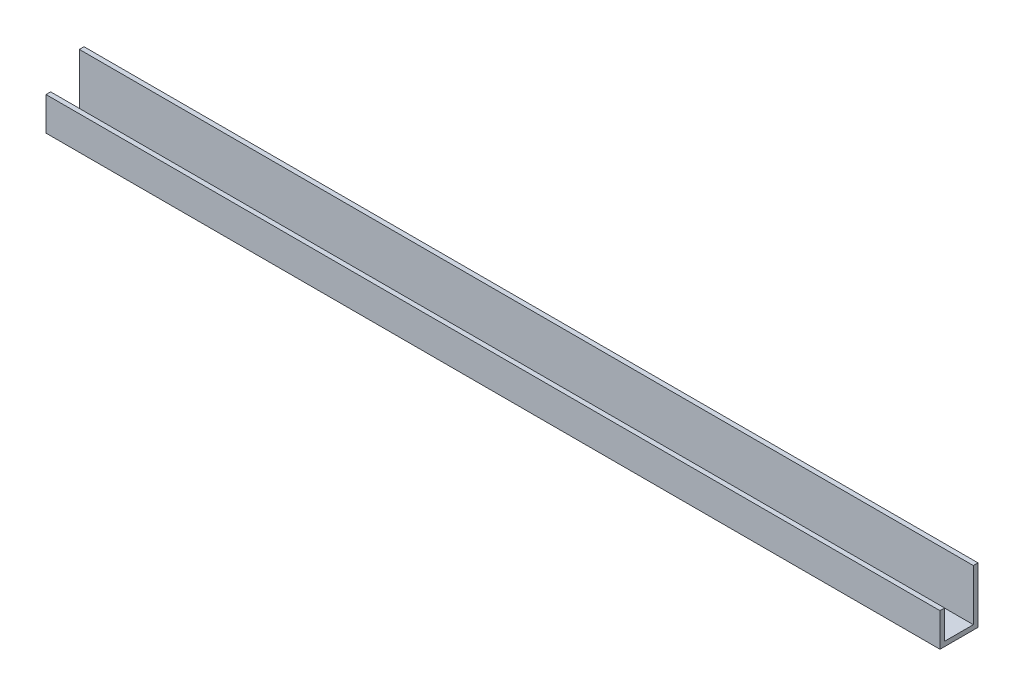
ISO-10303-21;
HEADER;
FILE_DESCRIPTION(('STEP AP214'),'2;1');
FILE_NAME('part.step','',(''),(''),'','','');
FILE_SCHEMA(('AUTOMOTIVE_DESIGN { 1 0 10303 214 1 1 1 1 }'));
ENDSEC;
DATA;
#1=APPLICATION_CONTEXT('core data for automotive mechanical design processes');
#2=APPLICATION_PROTOCOL_DEFINITION('international standard','automotive_design',2000,#1);
#3=PRODUCT_CONTEXT('',#1,'mechanical');
#4=PRODUCT('Part','Part','',(#3));
#5=PRODUCT_RELATED_PRODUCT_CATEGORY('part','',(#4));
#6=PRODUCT_DEFINITION_FORMATION('','',#4);
#7=PRODUCT_DEFINITION_CONTEXT('part definition',#1,'design');
#8=PRODUCT_DEFINITION('design','',#6,#7);
#9=PRODUCT_DEFINITION_SHAPE('','',#8);
#10=(LENGTH_UNIT() NAMED_UNIT(*) SI_UNIT(.MILLI.,.METRE.));
#11=(NAMED_UNIT(*) PLANE_ANGLE_UNIT() SI_UNIT($,.RADIAN.));
#12=(NAMED_UNIT(*) SI_UNIT($,.STERADIAN.) SOLID_ANGLE_UNIT());
#13=UNCERTAINTY_MEASURE_WITH_UNIT(LENGTH_MEASURE(1.E-05),#10,'distance_accuracy_value','');
#14=(GEOMETRIC_REPRESENTATION_CONTEXT(3) GLOBAL_UNCERTAINTY_ASSIGNED_CONTEXT((#13)) GLOBAL_UNIT_ASSIGNED_CONTEXT((#10,
#11,#12)) REPRESENTATION_CONTEXT('',''));
#15=CARTESIAN_POINT('',(0.,0.,0.));
#16=DIRECTION('',(0.,0.,1.));
#17=DIRECTION('',(1.,0.,0.));
#18=AXIS2_PLACEMENT_3D('',#15,#16,#17);
#19=CARTESIAN_POINT('',(0.,19.05,0.));
#20=DIRECTION('',(0.,1.,0.));
#21=DIRECTION('',(0.,0.,1.));
#22=AXIS2_PLACEMENT_3D('',#19,#20,#21);
#23=PLANE('',#22);
#24=DIRECTION('',(-1.,0.,0.));
#25=VECTOR('',#24,1.);
#26=CARTESIAN_POINT('',(0.,19.05,1.5875));
#27=LINE('',#26,#25);
#28=CARTESIAN_POINT('',(304.8,19.05,1.5875));
#29=VERTEX_POINT('',#28);
#30=CARTESIAN_POINT('',(0.,19.05,1.5875));
#31=VERTEX_POINT('',#30);
#32=EDGE_CURVE('E165',#29,#31,#27,.T.);
#33=ORIENTED_EDGE('',*,*,#32,.F.);
#34=DIRECTION('',(0.,0.,-1.));
#35=VECTOR('',#34,1.);
#36=CARTESIAN_POINT('',(304.8,19.05,0.));
#37=LINE('',#36,#35);
#38=CARTESIAN_POINT('',(304.8,19.05,0.));
#39=VERTEX_POINT('',#38);
#40=EDGE_CURVE('E177',#29,#39,#37,.T.);
#41=ORIENTED_EDGE('',*,*,#40,.T.);
#42=DIRECTION('',(-1.,0.,0.));
#43=VECTOR('',#42,1.);
#44=CARTESIAN_POINT('',(0.,19.05,0.));
#45=LINE('',#44,#43);
#46=CARTESIAN_POINT('',(0.,19.05,0.));
#47=VERTEX_POINT('',#46);
#48=EDGE_CURVE('E70',#39,#47,#45,.T.);
#49=ORIENTED_EDGE('',*,*,#48,.T.);
#50=DIRECTION('',(0.,0.,1.));
#51=VECTOR('',#50,1.);
#52=CARTESIAN_POINT('',(0.,19.05,0.));
#53=LINE('',#52,#51);
#54=EDGE_CURVE('E99',#47,#31,#53,.T.);
#55=ORIENTED_EDGE('',*,*,#54,.T.);
#56=EDGE_LOOP('',(#33,#41,#49,#55));
#57=FACE_BOUND('',#56,.T.);
#58=ADVANCED_FACE('F45',(#57),#23,.T.);
#59=CARTESIAN_POINT('',(0.,19.05,0.));
#60=DIRECTION('',(1.,0.,0.));
#61=DIRECTION('',(0.,0.,-1.));
#62=AXIS2_PLACEMENT_3D('',#59,#60,#61);
#63=PLANE('',#62);
#64=DIRECTION('',(0.,-1.,0.));
#65=VECTOR('',#64,1.);
#66=CARTESIAN_POINT('',(0.,19.05,12.954));
#67=LINE('',#66,#65);
#68=CARTESIAN_POINT('',(0.,11.4046,12.954));
#69=VERTEX_POINT('',#68);
#70=CARTESIAN_POINT('',(0.,0.,12.954));
#71=VERTEX_POINT('',#70);
#72=EDGE_CURVE('E11',#69,#71,#67,.T.);
#73=ORIENTED_EDGE('',*,*,#72,.F.);
#74=DIRECTION('',(0.,0.,1.));
#75=VECTOR('',#74,1.);
#76=CARTESIAN_POINT('',(0.,11.4046,-0.000999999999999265));
#77=LINE('',#76,#75);
#78=CARTESIAN_POINT('',(0.,11.4046,11.3665));
#79=VERTEX_POINT('',#78);
#80=EDGE_CURVE('E142',#79,#69,#77,.T.);
#81=ORIENTED_EDGE('',*,*,#80,.F.);
#82=DIRECTION('',(0.,1.,0.));
#83=VECTOR('',#82,1.);
#84=CARTESIAN_POINT('',(0.,1.5875,11.3665));
#85=LINE('',#84,#83);
#86=CARTESIAN_POINT('',(0.,1.5875,11.3665));
#87=VERTEX_POINT('',#86);
#88=EDGE_CURVE('E181',#87,#79,#85,.T.);
#89=ORIENTED_EDGE('',*,*,#88,.F.);
#90=DIRECTION('',(0.,0.,1.));
#91=VECTOR('',#90,1.);
#92=CARTESIAN_POINT('',(0.,1.5875,1.5875));
#93=LINE('',#92,#91);
#94=CARTESIAN_POINT('',(0.,1.5875,1.5875));
#95=VERTEX_POINT('',#94);
#96=EDGE_CURVE('E172',#95,#87,#93,.T.);
#97=ORIENTED_EDGE('',*,*,#96,.F.);
#98=DIRECTION('',(0.,1.,0.));
#99=VECTOR('',#98,1.);
#100=CARTESIAN_POINT('',(0.,1.5875,1.5875));
#101=LINE('',#100,#99);
#102=EDGE_CURVE('E114',#95,#31,#101,.T.);
#103=ORIENTED_EDGE('',*,*,#102,.T.);
#104=ORIENTED_EDGE('',*,*,#54,.F.);
#105=DIRECTION('',(0.,-1.,0.));
#106=VECTOR('',#105,1.);
#107=CARTESIAN_POINT('',(0.,19.05,0.));
#108=LINE('',#107,#106);
#109=CARTESIAN_POINT('',(0.,0.,0.));
#110=VERTEX_POINT('',#109);
#111=EDGE_CURVE('E91',#47,#110,#108,.T.);
#112=ORIENTED_EDGE('',*,*,#111,.T.);
#113=DIRECTION('',(0.,0.,1.));
#114=VECTOR('',#113,1.);
#115=CARTESIAN_POINT('',(0.,0.,0.));
#116=LINE('',#115,#114);
#117=EDGE_CURVE('E105',#110,#71,#116,.T.);
#118=ORIENTED_EDGE('',*,*,#117,.T.);
#119=EDGE_LOOP('',(#73,#81,#89,#97,#103,#104,#112,#118));
#120=FACE_BOUND('',#119,.T.);
#121=ADVANCED_FACE('F47',(#120),#63,.F.);
#122=CARTESIAN_POINT('',(0.,19.05,12.954));
#123=DIRECTION('',(0.,0.,-1.));
#124=DIRECTION('',(-1.,0.,0.));
#125=AXIS2_PLACEMENT_3D('',#122,#123,#124);
#126=PLANE('',#125);
#127=DIRECTION('',(0.,-1.,0.));
#128=VECTOR('',#127,1.);
#129=CARTESIAN_POINT('',(304.8,19.05,12.954));
#130=LINE('',#129,#128);
#131=CARTESIAN_POINT('',(304.8,11.4046,12.954));
#132=VERTEX_POINT('',#131);
#133=CARTESIAN_POINT('',(304.8,0.,12.954));
#134=VERTEX_POINT('',#133);
#135=EDGE_CURVE('E54',#132,#134,#130,.T.);
#136=ORIENTED_EDGE('',*,*,#135,.F.);
#137=DIRECTION('',(1.,0.,0.));
#138=VECTOR('',#137,1.);
#139=CARTESIAN_POINT('',(0.,11.4046,12.954));
#140=LINE('',#139,#138);
#141=EDGE_CURVE('E137',#69,#132,#140,.T.);
#142=ORIENTED_EDGE('',*,*,#141,.F.);
#143=ORIENTED_EDGE('',*,*,#72,.T.);
#144=DIRECTION('',(1.,0.,0.));
#145=VECTOR('',#144,1.);
#146=CARTESIAN_POINT('',(0.,0.,12.954));
#147=LINE('',#146,#145);
#148=EDGE_CURVE('E112',#71,#134,#147,.T.);
#149=ORIENTED_EDGE('',*,*,#148,.T.);
#150=EDGE_LOOP('',(#136,#142,#143,#149));
#151=FACE_BOUND('',#150,.T.);
#152=ADVANCED_FACE('F135',(#151),#126,.F.);
#153=CARTESIAN_POINT('',(304.8,19.05,0.));
#154=DIRECTION('',(-1.,0.,0.));
#155=DIRECTION('',(0.,0.,1.));
#156=AXIS2_PLACEMENT_3D('',#153,#154,#155);
#157=PLANE('',#156);
#158=DIRECTION('',(0.,1.,0.));
#159=VECTOR('',#158,1.);
#160=CARTESIAN_POINT('',(304.8,1.5875,11.3665));
#161=LINE('',#160,#159);
#162=CARTESIAN_POINT('',(304.8,1.5875,11.3665));
#163=VERTEX_POINT('',#162);
#164=CARTESIAN_POINT('',(304.8,11.4046,11.3665));
#165=VERTEX_POINT('',#164);
#166=EDGE_CURVE('E184',#163,#165,#161,.T.);
#167=ORIENTED_EDGE('',*,*,#166,.T.);
#168=DIRECTION('',(0.,0.,1.));
#169=VECTOR('',#168,1.);
#170=CARTESIAN_POINT('',(304.8,11.4046,-0.000999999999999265));
#171=LINE('',#170,#169);
#172=EDGE_CURVE('E61',#165,#132,#171,.T.);
#173=ORIENTED_EDGE('',*,*,#172,.T.);
#174=ORIENTED_EDGE('',*,*,#135,.T.);
#175=DIRECTION('',(0.,0.,-1.));
#176=VECTOR('',#175,1.);
#177=CARTESIAN_POINT('',(304.8,0.,0.));
#178=LINE('',#177,#176);
#179=CARTESIAN_POINT('',(304.8,0.,0.));
#180=VERTEX_POINT('',#179);
#181=EDGE_CURVE('E100',#134,#180,#178,.T.);
#182=ORIENTED_EDGE('',*,*,#181,.T.);
#183=DIRECTION('',(0.,-1.,0.));
#184=VECTOR('',#183,1.);
#185=CARTESIAN_POINT('',(304.8,19.05,0.));
#186=LINE('',#185,#184);
#187=EDGE_CURVE('E94',#39,#180,#186,.T.);
#188=ORIENTED_EDGE('',*,*,#187,.F.);
#189=ORIENTED_EDGE('',*,*,#40,.F.);
#190=DIRECTION('',(0.,1.,0.));
#191=VECTOR('',#190,1.);
#192=CARTESIAN_POINT('',(304.8,1.5875,1.5875));
#193=LINE('',#192,#191);
#194=CARTESIAN_POINT('',(304.8,1.5875,1.5875));
#195=VERTEX_POINT('',#194);
#196=EDGE_CURVE('E119',#195,#29,#193,.T.);
#197=ORIENTED_EDGE('',*,*,#196,.F.);
#198=DIRECTION('',(0.,0.,-1.));
#199=VECTOR('',#198,1.);
#200=CARTESIAN_POINT('',(304.8,1.5875,1.5875));
#201=LINE('',#200,#199);
#202=EDGE_CURVE('E192',#163,#195,#201,.T.);
#203=ORIENTED_EDGE('',*,*,#202,.F.);
#204=EDGE_LOOP('',(#167,#173,#174,#182,#188,#189,#197,#203));
#205=FACE_BOUND('',#204,.T.);
#206=ADVANCED_FACE('F131',(#205),#157,.F.);
#207=CARTESIAN_POINT('',(0.,19.05,0.));
#208=DIRECTION('',(0.,0.,1.));
#209=DIRECTION('',(1.,0.,0.));
#210=AXIS2_PLACEMENT_3D('',#207,#208,#209);
#211=PLANE('',#210);
#212=DIRECTION('',(-1.,0.,0.));
#213=VECTOR('',#212,1.);
#214=CARTESIAN_POINT('',(0.,0.,0.));
#215=LINE('',#214,#213);
#216=EDGE_CURVE('E88',#180,#110,#215,.T.);
#217=ORIENTED_EDGE('',*,*,#216,.T.);
#218=ORIENTED_EDGE('',*,*,#111,.F.);
#219=ORIENTED_EDGE('',*,*,#48,.F.);
#220=ORIENTED_EDGE('',*,*,#187,.T.);
#221=EDGE_LOOP('',(#217,#218,#219,#220));
#222=FACE_BOUND('',#221,.T.);
#223=ADVANCED_FACE('F90',(#222),#211,.F.);
#224=CARTESIAN_POINT('',(0.,0.,0.));
#225=DIRECTION('',(0.,1.,0.));
#226=DIRECTION('',(0.,0.,1.));
#227=AXIS2_PLACEMENT_3D('',#224,#225,#226);
#228=PLANE('',#227);
#229=ORIENTED_EDGE('',*,*,#117,.F.);
#230=ORIENTED_EDGE('',*,*,#216,.F.);
#231=ORIENTED_EDGE('',*,*,#181,.F.);
#232=ORIENTED_EDGE('',*,*,#148,.F.);
#233=EDGE_LOOP('',(#229,#230,#231,#232));
#234=FACE_BOUND('',#233,.T.);
#235=ADVANCED_FACE('F110',(#234),#228,.F.);
#236=CARTESIAN_POINT('',(0.,1.5875,1.5875));
#237=DIRECTION('',(0.,0.,-1.));
#238=DIRECTION('',(-1.,0.,0.));
#239=AXIS2_PLACEMENT_3D('',#236,#237,#238);
#240=PLANE('',#239);
#241=ORIENTED_EDGE('',*,*,#32,.T.);
#242=ORIENTED_EDGE('',*,*,#102,.F.);
#243=DIRECTION('',(-1.,0.,0.));
#244=VECTOR('',#243,1.);
#245=CARTESIAN_POINT('',(0.,1.5875,1.5875));
#246=LINE('',#245,#244);
#247=EDGE_CURVE('E185',#195,#95,#246,.T.);
#248=ORIENTED_EDGE('',*,*,#247,.F.);
#249=ORIENTED_EDGE('',*,*,#196,.T.);
#250=EDGE_LOOP('',(#241,#242,#248,#249));
#251=FACE_BOUND('',#250,.T.);
#252=ADVANCED_FACE('F166',(#251),#240,.F.);
#253=CARTESIAN_POINT('',(0.,1.5875,11.3665));
#254=DIRECTION('',(0.,0.,1.));
#255=DIRECTION('',(1.,0.,0.));
#256=AXIS2_PLACEMENT_3D('',#253,#254,#255);
#257=PLANE('',#256);
#258=ORIENTED_EDGE('',*,*,#88,.T.);
#259=DIRECTION('',(-1.,0.,0.));
#260=VECTOR('',#259,1.);
#261=CARTESIAN_POINT('',(0.,11.4046,11.3665));
#262=LINE('',#261,#260);
#263=EDGE_CURVE('E207',#165,#79,#262,.T.);
#264=ORIENTED_EDGE('',*,*,#263,.F.);
#265=ORIENTED_EDGE('',*,*,#166,.F.);
#266=DIRECTION('',(1.,0.,0.));
#267=VECTOR('',#266,1.);
#268=CARTESIAN_POINT('',(0.,1.5875,11.3665));
#269=LINE('',#268,#267);
#270=EDGE_CURVE('E195',#87,#163,#269,.T.);
#271=ORIENTED_EDGE('',*,*,#270,.F.);
#272=EDGE_LOOP('',(#258,#264,#265,#271));
#273=FACE_BOUND('',#272,.T.);
#274=ADVANCED_FACE('F211',(#273),#257,.F.);
#275=CARTESIAN_POINT('',(0.,1.5875,0.));
#276=DIRECTION('',(0.,1.,0.));
#277=DIRECTION('',(0.,0.,1.));
#278=AXIS2_PLACEMENT_3D('',#275,#276,#277);
#279=PLANE('',#278);
#280=ORIENTED_EDGE('',*,*,#96,.T.);
#281=ORIENTED_EDGE('',*,*,#270,.T.);
#282=ORIENTED_EDGE('',*,*,#202,.T.);
#283=ORIENTED_EDGE('',*,*,#247,.T.);
#284=EDGE_LOOP('',(#280,#281,#282,#283));
#285=FACE_BOUND('',#284,.T.);
#286=ADVANCED_FACE('F214',(#285),#279,.T.);
#287=CARTESIAN_POINT('',(0.,11.4046,-0.000999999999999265));
#288=DIRECTION('',(0.,-1.,0.));
#289=DIRECTION('',(0.,0.,-1.));
#290=AXIS2_PLACEMENT_3D('',#287,#288,#289);
#291=PLANE('',#290);
#292=ORIENTED_EDGE('',*,*,#263,.T.);
#293=ORIENTED_EDGE('',*,*,#80,.T.);
#294=ORIENTED_EDGE('',*,*,#141,.T.);
#295=ORIENTED_EDGE('',*,*,#172,.F.);
#296=EDGE_LOOP('',(#292,#293,#294,#295));
#297=FACE_BOUND('',#296,.T.);
#298=ADVANCED_FACE('F209',(#297),#291,.F.);
#299=CLOSED_SHELL('',(#58,#121,#152,#206,#223,#235,#252,#274,#286,#298));
#300=MANIFOLD_SOLID_BREP('B2',#299);
#301=ADVANCED_BREP_SHAPE_REPRESENTATION('',(#18,#300),#14);
#302=SHAPE_DEFINITION_REPRESENTATION(#9,#301);
ENDSEC;
END-ISO-10303-21;
